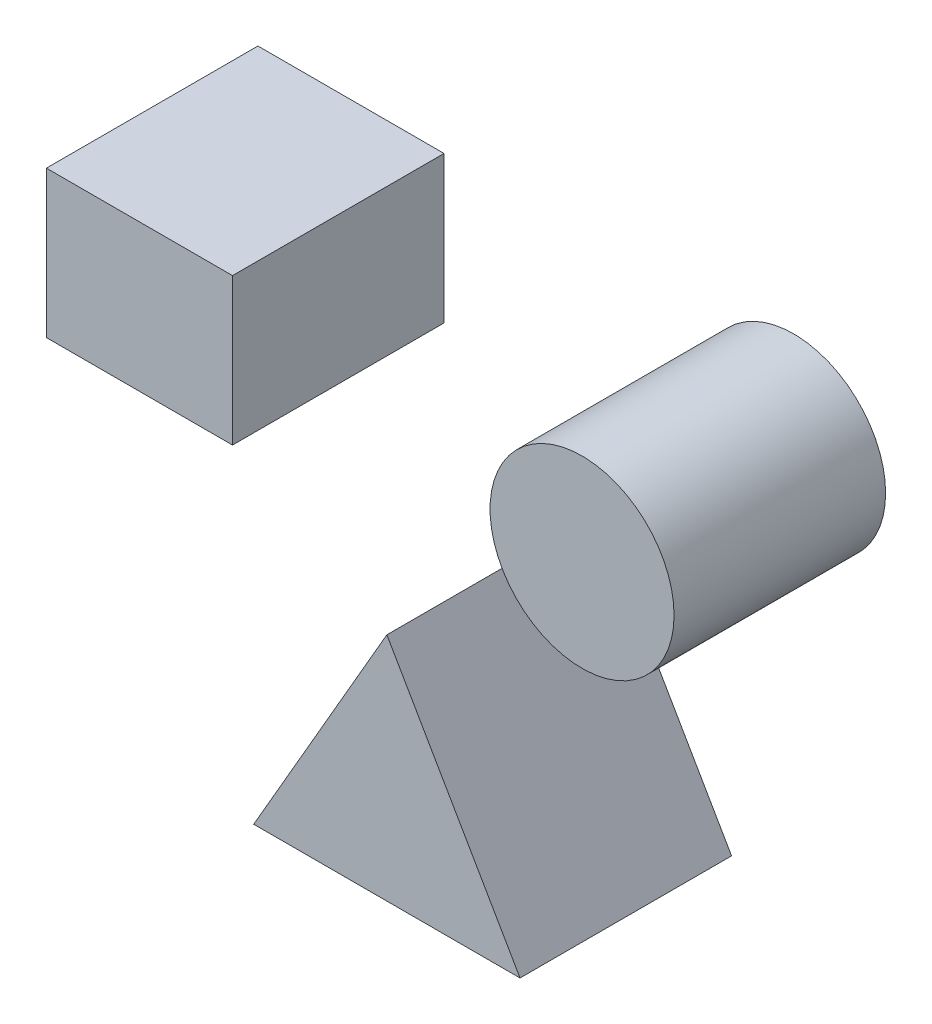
ISO-10303-21;
HEADER;
FILE_DESCRIPTION(('STEP AP214'),'2;1');
FILE_NAME('part.step','',(''),(''),'','','');
FILE_SCHEMA(('AUTOMOTIVE_DESIGN { 1 0 10303 214 1 1 1 1 }'));
ENDSEC;
DATA;
#1=APPLICATION_CONTEXT('core data for automotive mechanical design processes');
#2=APPLICATION_PROTOCOL_DEFINITION('international standard','automotive_design',2000,#1);
#3=PRODUCT_CONTEXT('',#1,'mechanical');
#4=PRODUCT('Part','Part','',(#3));
#5=PRODUCT_RELATED_PRODUCT_CATEGORY('part','',(#4));
#6=PRODUCT_DEFINITION_FORMATION('','',#4);
#7=PRODUCT_DEFINITION_CONTEXT('part definition',#1,'design');
#8=PRODUCT_DEFINITION('design','',#6,#7);
#9=PRODUCT_DEFINITION_SHAPE('','',#8);
#10=(LENGTH_UNIT() NAMED_UNIT(*) SI_UNIT(.MILLI.,.METRE.));
#11=(NAMED_UNIT(*) PLANE_ANGLE_UNIT() SI_UNIT($,.RADIAN.));
#12=(NAMED_UNIT(*) SI_UNIT($,.STERADIAN.) SOLID_ANGLE_UNIT());
#13=UNCERTAINTY_MEASURE_WITH_UNIT(LENGTH_MEASURE(1.E-05),#10,'distance_accuracy_value','');
#14=(GEOMETRIC_REPRESENTATION_CONTEXT(3) GLOBAL_UNCERTAINTY_ASSIGNED_CONTEXT((#13)) GLOBAL_UNIT_ASSIGNED_CONTEXT((#10,
#11,#12)) REPRESENTATION_CONTEXT('',''));
#15=CARTESIAN_POINT('',(0.,0.,0.));
#16=DIRECTION('',(0.,0.,1.));
#17=DIRECTION('',(1.,0.,0.));
#18=AXIS2_PLACEMENT_3D('',#15,#16,#17);
#19=CARTESIAN_POINT('',(28.9433565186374,-39.3678705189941,34.29));
#20=DIRECTION('',(0.,1.,0.));
#21=DIRECTION('',(0.,0.,1.));
#22=AXIS2_PLACEMENT_3D('',#19,#20,#21);
#23=PLANE('',#22);
#24=DIRECTION('',(1.,0.,0.));
#25=VECTOR('',#24,1.);
#26=CARTESIAN_POINT('',(28.9433565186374,-39.3678705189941,0.));
#27=LINE('',#26,#25);
#28=CARTESIAN_POINT('',(-14.2263955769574,-39.3678705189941,0.));
#29=VERTEX_POINT('',#28);
#30=CARTESIAN_POINT('',(28.9433565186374,-39.3678705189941,0.));
#31=VERTEX_POINT('',#30);
#32=EDGE_CURVE('E71',#29,#31,#27,.T.);
#33=ORIENTED_EDGE('',*,*,#32,.T.);
#34=DIRECTION('',(0.,0.,-1.));
#35=VECTOR('',#34,1.);
#36=CARTESIAN_POINT('',(28.9433565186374,-39.3678705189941,34.29));
#37=LINE('',#36,#35);
#38=CARTESIAN_POINT('',(28.9433565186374,-39.3678705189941,34.29));
#39=VERTEX_POINT('',#38);
#40=EDGE_CURVE('E12',#39,#31,#37,.T.);
#41=ORIENTED_EDGE('',*,*,#40,.F.);
#42=DIRECTION('',(1.,0.,0.));
#43=VECTOR('',#42,1.);
#44=CARTESIAN_POINT('',(28.9433565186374,-39.3678705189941,34.29));
#45=LINE('',#44,#43);
#46=CARTESIAN_POINT('',(-14.2263955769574,-39.3678705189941,34.29));
#47=VERTEX_POINT('',#46);
#48=EDGE_CURVE('E85',#47,#39,#45,.T.);
#49=ORIENTED_EDGE('',*,*,#48,.F.);
#50=DIRECTION('',(0.,0.,-1.));
#51=VECTOR('',#50,1.);
#52=CARTESIAN_POINT('',(-14.2263955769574,-39.3678705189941,34.29));
#53=LINE('',#52,#51);
#54=EDGE_CURVE('E81',#47,#29,#53,.T.);
#55=ORIENTED_EDGE('',*,*,#54,.T.);
#56=EDGE_LOOP('',(#33,#41,#49,#55));
#57=FACE_BOUND('',#56,.T.);
#58=ADVANCED_FACE('F35',(#57),#23,.F.);
#59=CARTESIAN_POINT('',(7.35848047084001,-1.98176852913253,34.29));
#60=DIRECTION('',(-0.866025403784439,-0.5,0.));
#61=DIRECTION('',(0.5,-0.866025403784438,0.));
#62=AXIS2_PLACEMENT_3D('',#59,#60,#61);
#63=PLANE('',#62);
#64=DIRECTION('',(-0.5,0.866025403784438,0.));
#65=VECTOR('',#64,1.);
#66=CARTESIAN_POINT('',(7.35848047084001,-1.98176852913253,0.));
#67=LINE('',#66,#65);
#68=CARTESIAN_POINT('',(7.35848047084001,-1.98176852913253,0.));
#69=VERTEX_POINT('',#68);
#70=EDGE_CURVE('E68',#31,#69,#67,.T.);
#71=ORIENTED_EDGE('',*,*,#70,.T.);
#72=DIRECTION('',(0.,0.,-1.));
#73=VECTOR('',#72,1.);
#74=CARTESIAN_POINT('',(7.35848047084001,-1.98176852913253,34.29));
#75=LINE('',#74,#73);
#76=CARTESIAN_POINT('',(7.35848047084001,-1.98176852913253,34.29));
#77=VERTEX_POINT('',#76);
#78=EDGE_CURVE('E42',#77,#69,#75,.T.);
#79=ORIENTED_EDGE('',*,*,#78,.F.);
#80=DIRECTION('',(-0.5,0.866025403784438,0.));
#81=VECTOR('',#80,1.);
#82=CARTESIAN_POINT('',(7.35848047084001,-1.98176852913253,34.29));
#83=LINE('',#82,#81);
#84=EDGE_CURVE('E53',#39,#77,#83,.T.);
#85=ORIENTED_EDGE('',*,*,#84,.F.);
#86=ORIENTED_EDGE('',*,*,#40,.T.);
#87=EDGE_LOOP('',(#71,#79,#85,#86));
#88=FACE_BOUND('',#87,.T.);
#89=ADVANCED_FACE('F77',(#88),#63,.F.);
#90=CARTESIAN_POINT('',(-14.2263955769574,-39.3678705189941,34.29));
#91=DIRECTION('',(0.866025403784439,-0.5,0.));
#92=DIRECTION('',(0.5,0.866025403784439,0.));
#93=AXIS2_PLACEMENT_3D('',#90,#91,#92);
#94=PLANE('',#93);
#95=DIRECTION('',(-0.5,-0.866025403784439,0.));
#96=VECTOR('',#95,1.);
#97=CARTESIAN_POINT('',(-14.2263955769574,-39.3678705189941,0.));
#98=LINE('',#97,#96);
#99=EDGE_CURVE('E72',#69,#29,#98,.T.);
#100=ORIENTED_EDGE('',*,*,#99,.T.);
#101=ORIENTED_EDGE('',*,*,#54,.F.);
#102=DIRECTION('',(-0.5,-0.866025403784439,0.));
#103=VECTOR('',#102,1.);
#104=CARTESIAN_POINT('',(-14.2263955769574,-39.3678705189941,34.29));
#105=LINE('',#104,#103);
#106=EDGE_CURVE('E49',#77,#47,#105,.T.);
#107=ORIENTED_EDGE('',*,*,#106,.F.);
#108=ORIENTED_EDGE('',*,*,#78,.T.);
#109=EDGE_LOOP('',(#100,#101,#107,#108));
#110=FACE_BOUND('',#109,.T.);
#111=ADVANCED_FACE('F90',(#110),#94,.F.);
#112=CARTESIAN_POINT('',(-14.2263955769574,-39.3678705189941,34.29));
#113=DIRECTION('',(0.,0.,-1.));
#114=DIRECTION('',(-1.,0.,0.));
#115=AXIS2_PLACEMENT_3D('',#112,#113,#114);
#116=PLANE('',#115);
#117=ORIENTED_EDGE('',*,*,#48,.T.);
#118=ORIENTED_EDGE('',*,*,#84,.T.);
#119=ORIENTED_EDGE('',*,*,#106,.T.);
#120=EDGE_LOOP('',(#117,#118,#119));
#121=FACE_BOUND('',#120,.T.);
#122=ADVANCED_FACE('F91',(#121),#116,.F.);
#123=CARTESIAN_POINT('',(-14.2263955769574,-39.3678705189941,0.));
#124=DIRECTION('',(0.,0.,-1.));
#125=DIRECTION('',(-1.,0.,0.));
#126=AXIS2_PLACEMENT_3D('',#123,#124,#125);
#127=PLANE('',#126);
#128=ORIENTED_EDGE('',*,*,#32,.F.);
#129=ORIENTED_EDGE('',*,*,#99,.F.);
#130=ORIENTED_EDGE('',*,*,#70,.F.);
#131=EDGE_LOOP('',(#128,#129,#130));
#132=FACE_BOUND('',#131,.T.);
#133=ADVANCED_FACE('F69',(#132),#127,.T.);
#134=CLOSED_SHELL('',(#58,#89,#111,#122,#133));
#135=MANIFOLD_SOLID_BREP('B2',#134);
#136=CARTESIAN_POINT('',(38.9999464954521,24.0377028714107,34.29));
#137=DIRECTION('',(0.,0.,-1.));
#138=DIRECTION('',(-1.,0.,0.));
#139=AXIS2_PLACEMENT_3D('',#136,#137,#138);
#140=CYLINDRICAL_SURFACE('',#139,14.9124003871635);
#141=CARTESIAN_POINT('',(38.9999464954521,24.0377028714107,34.29));
#142=DIRECTION('',(0.,0.,1.));
#143=DIRECTION('',(1.,0.,0.));
#144=AXIS2_PLACEMENT_3D('',#141,#142,#143);
#145=CIRCLE('',#144,14.9124003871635);
#146=CARTESIAN_POINT('',(53.9123468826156,24.0377028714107,34.29));
#147=VERTEX_POINT('',#146);
#148=EDGE_CURVE('E34',#147,#147,#145,.T.);
#149=ORIENTED_EDGE('',*,*,#148,.F.);
#150=EDGE_LOOP('',(#149));
#151=FACE_BOUND('',#150,.T.);
#152=CARTESIAN_POINT('',(38.9999464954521,24.0377028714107,0.));
#153=DIRECTION('',(0.,0.,1.));
#154=DIRECTION('',(1.,0.,0.));
#155=AXIS2_PLACEMENT_3D('',#152,#153,#154);
#156=CIRCLE('',#155,14.9124003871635);
#157=CARTESIAN_POINT('',(53.9123468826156,24.0377028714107,0.));
#158=VERTEX_POINT('',#157);
#159=EDGE_CURVE('E137',#158,#158,#156,.T.);
#160=ORIENTED_EDGE('',*,*,#159,.T.);
#161=EDGE_LOOP('',(#160));
#162=FACE_BOUND('',#161,.T.);
#163=ADVANCED_FACE('F131',(#151,#162),#140,.T.);
#164=CARTESIAN_POINT('',(38.9999464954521,24.0377028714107,34.29));
#165=DIRECTION('',(0.,0.,1.));
#166=DIRECTION('',(1.,0.,0.));
#167=AXIS2_PLACEMENT_3D('',#164,#165,#166);
#168=PLANE('',#167);
#169=ORIENTED_EDGE('',*,*,#148,.T.);
#170=EDGE_LOOP('',(#169));
#171=FACE_BOUND('',#170,.T.);
#172=ADVANCED_FACE('F146',(#171),#168,.T.);
#173=CARTESIAN_POINT('',(38.9999464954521,24.0377028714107,0.));
#174=DIRECTION('',(0.,0.,1.));
#175=DIRECTION('',(1.,0.,0.));
#176=AXIS2_PLACEMENT_3D('',#173,#174,#175);
#177=PLANE('',#176);
#178=ORIENTED_EDGE('',*,*,#159,.F.);
#179=EDGE_LOOP('',(#178));
#180=FACE_BOUND('',#179,.T.);
#181=ADVANCED_FACE('F144',(#180),#177,.F.);
#182=CLOSED_SHELL('',(#163,#172,#181));
#183=MANIFOLD_SOLID_BREP('B6',#182);
#184=CARTESIAN_POINT('',(-47.8301230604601,35.9339129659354,34.29));
#185=DIRECTION('',(1.,0.,0.));
#186=DIRECTION('',(0.,0.,-1.));
#187=AXIS2_PLACEMENT_3D('',#184,#185,#186);
#188=PLANE('',#187);
#189=DIRECTION('',(0.,-1.,0.));
#190=VECTOR('',#189,1.);
#191=CARTESIAN_POINT('',(-47.8301230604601,35.9339129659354,0.));
#192=LINE('',#191,#190);
#193=CARTESIAN_POINT('',(-47.8301230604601,35.9339129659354,0.));
#194=VERTEX_POINT('',#193);
#195=CARTESIAN_POINT('',(-47.8301230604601,12.141492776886,0.));
#196=VERTEX_POINT('',#195);
#197=EDGE_CURVE('E209',#194,#196,#192,.T.);
#198=ORIENTED_EDGE('',*,*,#197,.T.);
#199=DIRECTION('',(0.,0.,-1.));
#200=VECTOR('',#199,1.);
#201=CARTESIAN_POINT('',(-47.8301230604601,12.141492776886,34.29));
#202=LINE('',#201,#200);
#203=CARTESIAN_POINT('',(-47.8301230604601,12.141492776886,34.29));
#204=VERTEX_POINT('',#203);
#205=EDGE_CURVE('E129',#204,#196,#202,.T.);
#206=ORIENTED_EDGE('',*,*,#205,.F.);
#207=DIRECTION('',(0.,-1.,0.));
#208=VECTOR('',#207,1.);
#209=CARTESIAN_POINT('',(-47.8301230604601,35.9339129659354,34.29));
#210=LINE('',#209,#208);
#211=CARTESIAN_POINT('',(-47.8301230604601,35.9339129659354,34.29));
#212=VERTEX_POINT('',#211);
#213=EDGE_CURVE('E227',#212,#204,#210,.T.);
#214=ORIENTED_EDGE('',*,*,#213,.F.);
#215=DIRECTION('',(0.,0.,-1.));
#216=VECTOR('',#215,1.);
#217=CARTESIAN_POINT('',(-47.8301230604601,35.9339129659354,34.29));
#218=LINE('',#217,#216);
#219=EDGE_CURVE('E221',#212,#194,#218,.T.);
#220=ORIENTED_EDGE('',*,*,#219,.T.);
#221=EDGE_LOOP('',(#198,#206,#214,#220));
#222=FACE_BOUND('',#221,.T.);
#223=ADVANCED_FACE('F165',(#222),#188,.F.);
#224=CARTESIAN_POINT('',(-47.8301230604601,12.141492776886,34.29));
#225=DIRECTION('',(0.,1.,0.));
#226=DIRECTION('',(0.,0.,1.));
#227=AXIS2_PLACEMENT_3D('',#224,#225,#226);
#228=PLANE('',#227);
#229=DIRECTION('',(1.,0.,0.));
#230=VECTOR('',#229,1.);
#231=CARTESIAN_POINT('',(-47.8301230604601,12.141492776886,0.));
#232=LINE('',#231,#230);
#233=CARTESIAN_POINT('',(-17.660353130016,12.141492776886,0.));
#234=VERTEX_POINT('',#233);
#235=EDGE_CURVE('E205',#196,#234,#232,.T.);
#236=ORIENTED_EDGE('',*,*,#235,.T.);
#237=DIRECTION('',(0.,0.,-1.));
#238=VECTOR('',#237,1.);
#239=CARTESIAN_POINT('',(-17.660353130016,12.141492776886,34.29));
#240=LINE('',#239,#238);
#241=CARTESIAN_POINT('',(-17.660353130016,12.141492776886,34.29));
#242=VERTEX_POINT('',#241);
#243=EDGE_CURVE('E172',#242,#234,#240,.T.);
#244=ORIENTED_EDGE('',*,*,#243,.F.);
#245=DIRECTION('',(1.,0.,0.));
#246=VECTOR('',#245,1.);
#247=CARTESIAN_POINT('',(-47.8301230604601,12.141492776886,34.29));
#248=LINE('',#247,#246);
#249=EDGE_CURVE('E217',#204,#242,#248,.T.);
#250=ORIENTED_EDGE('',*,*,#249,.F.);
#251=ORIENTED_EDGE('',*,*,#205,.T.);
#252=EDGE_LOOP('',(#236,#244,#250,#251));
#253=FACE_BOUND('',#252,.T.);
#254=ADVANCED_FACE('F216',(#253),#228,.F.);
#255=CARTESIAN_POINT('',(-17.660353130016,35.9339129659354,34.29));
#256=DIRECTION('',(-1.,0.,0.));
#257=DIRECTION('',(0.,0.,1.));
#258=AXIS2_PLACEMENT_3D('',#255,#256,#257);
#259=PLANE('',#258);
#260=DIRECTION('',(0.,1.,0.));
#261=VECTOR('',#260,1.);
#262=CARTESIAN_POINT('',(-17.660353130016,35.9339129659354,0.));
#263=LINE('',#262,#261);
#264=CARTESIAN_POINT('',(-17.660353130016,35.9339129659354,0.));
#265=VERTEX_POINT('',#264);
#266=EDGE_CURVE('E210',#234,#265,#263,.T.);
#267=ORIENTED_EDGE('',*,*,#266,.T.);
#268=DIRECTION('',(0.,0.,-1.));
#269=VECTOR('',#268,1.);
#270=CARTESIAN_POINT('',(-17.660353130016,35.9339129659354,34.29));
#271=LINE('',#270,#269);
#272=CARTESIAN_POINT('',(-17.660353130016,35.9339129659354,34.29));
#273=VERTEX_POINT('',#272);
#274=EDGE_CURVE('E233',#273,#265,#271,.T.);
#275=ORIENTED_EDGE('',*,*,#274,.F.);
#276=DIRECTION('',(0.,1.,0.));
#277=VECTOR('',#276,1.);
#278=CARTESIAN_POINT('',(-17.660353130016,35.9339129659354,34.29));
#279=LINE('',#278,#277);
#280=EDGE_CURVE('E184',#242,#273,#279,.T.);
#281=ORIENTED_EDGE('',*,*,#280,.F.);
#282=ORIENTED_EDGE('',*,*,#243,.T.);
#283=EDGE_LOOP('',(#267,#275,#281,#282));
#284=FACE_BOUND('',#283,.T.);
#285=ADVANCED_FACE('F236',(#284),#259,.F.);
#286=CARTESIAN_POINT('',(-47.8301230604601,35.9339129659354,34.29));
#287=DIRECTION('',(0.,-1.,0.));
#288=DIRECTION('',(0.,0.,-1.));
#289=AXIS2_PLACEMENT_3D('',#286,#287,#288);
#290=PLANE('',#289);
#291=DIRECTION('',(-1.,0.,0.));
#292=VECTOR('',#291,1.);
#293=CARTESIAN_POINT('',(-47.8301230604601,35.9339129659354,0.));
#294=LINE('',#293,#292);
#295=EDGE_CURVE('E225',#265,#194,#294,.T.);
#296=ORIENTED_EDGE('',*,*,#295,.T.);
#297=ORIENTED_EDGE('',*,*,#219,.F.);
#298=DIRECTION('',(-1.,0.,0.));
#299=VECTOR('',#298,1.);
#300=CARTESIAN_POINT('',(-47.8301230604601,35.9339129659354,34.29));
#301=LINE('',#300,#299);
#302=EDGE_CURVE('E179',#273,#212,#301,.T.);
#303=ORIENTED_EDGE('',*,*,#302,.F.);
#304=ORIENTED_EDGE('',*,*,#274,.T.);
#305=EDGE_LOOP('',(#296,#297,#303,#304));
#306=FACE_BOUND('',#305,.T.);
#307=ADVANCED_FACE('F238',(#306),#290,.F.);
#308=CARTESIAN_POINT('',(-47.8301230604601,12.141492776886,34.29));
#309=DIRECTION('',(0.,0.,1.));
#310=DIRECTION('',(1.,0.,0.));
#311=AXIS2_PLACEMENT_3D('',#308,#309,#310);
#312=PLANE('',#311);
#313=ORIENTED_EDGE('',*,*,#213,.T.);
#314=ORIENTED_EDGE('',*,*,#249,.T.);
#315=ORIENTED_EDGE('',*,*,#280,.T.);
#316=ORIENTED_EDGE('',*,*,#302,.T.);
#317=EDGE_LOOP('',(#313,#314,#315,#316));
#318=FACE_BOUND('',#317,.T.);
#319=ADVANCED_FACE('F239',(#318),#312,.T.);
#320=CARTESIAN_POINT('',(-47.8301230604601,12.141492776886,0.));
#321=DIRECTION('',(0.,0.,1.));
#322=DIRECTION('',(1.,0.,0.));
#323=AXIS2_PLACEMENT_3D('',#320,#321,#322);
#324=PLANE('',#323);
#325=ORIENTED_EDGE('',*,*,#197,.F.);
#326=ORIENTED_EDGE('',*,*,#295,.F.);
#327=ORIENTED_EDGE('',*,*,#266,.F.);
#328=ORIENTED_EDGE('',*,*,#235,.F.);
#329=EDGE_LOOP('',(#325,#326,#327,#328));
#330=FACE_BOUND('',#329,.T.);
#331=ADVANCED_FACE('F206',(#330),#324,.F.);
#332=CLOSED_SHELL('',(#223,#254,#285,#307,#319,#331));
#333=MANIFOLD_SOLID_BREP('B29',#332);
#334=ADVANCED_BREP_SHAPE_REPRESENTATION('',(#18,#135,#183,#333),#14);
#335=SHAPE_DEFINITION_REPRESENTATION(#9,#334);
ENDSEC;
END-ISO-10303-21;
